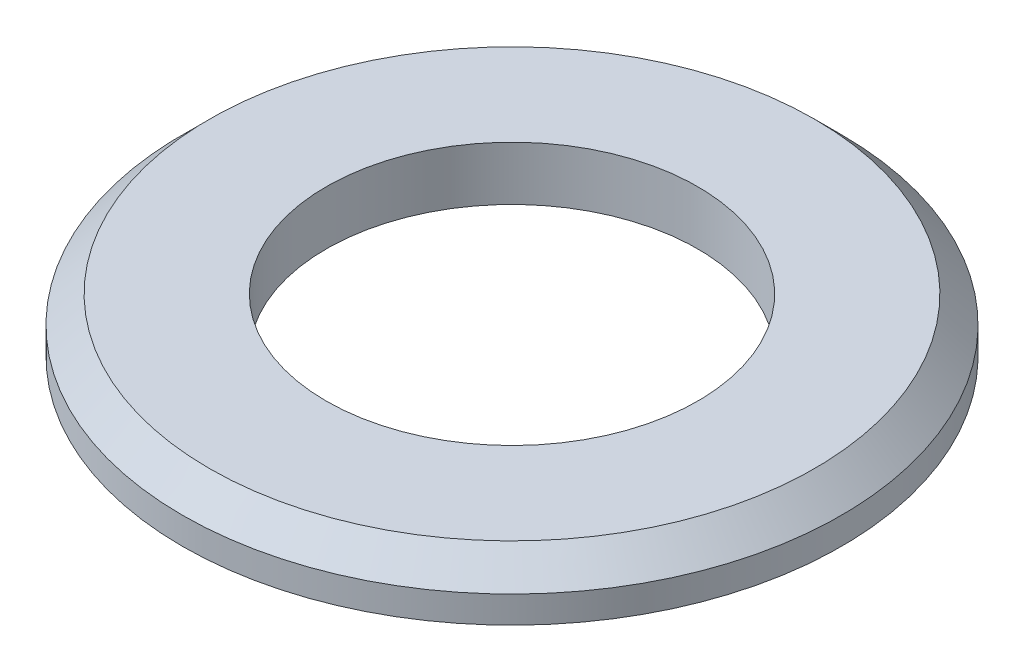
ISO-10303-21;
HEADER;
FILE_DESCRIPTION(('STEP AP214'),'2;1');
FILE_NAME('part.step','',(''),(''),'','','');
FILE_SCHEMA(('AUTOMOTIVE_DESIGN { 1 0 10303 214 1 1 1 1 }'));
ENDSEC;
DATA;
#1=APPLICATION_CONTEXT('core data for automotive mechanical design processes');
#2=APPLICATION_PROTOCOL_DEFINITION('international standard','automotive_design',2000,#1);
#3=PRODUCT_CONTEXT('',#1,'mechanical');
#4=PRODUCT('Part','Part','',(#3));
#5=PRODUCT_RELATED_PRODUCT_CATEGORY('part','',(#4));
#6=PRODUCT_DEFINITION_FORMATION('','',#4);
#7=PRODUCT_DEFINITION_CONTEXT('part definition',#1,'design');
#8=PRODUCT_DEFINITION('design','',#6,#7);
#9=PRODUCT_DEFINITION_SHAPE('','',#8);
#10=(LENGTH_UNIT() NAMED_UNIT(*) SI_UNIT(.MILLI.,.METRE.));
#11=(NAMED_UNIT(*) PLANE_ANGLE_UNIT() SI_UNIT($,.RADIAN.));
#12=(NAMED_UNIT(*) SI_UNIT($,.STERADIAN.) SOLID_ANGLE_UNIT());
#13=UNCERTAINTY_MEASURE_WITH_UNIT(LENGTH_MEASURE(1.E-05),#10,'distance_accuracy_value','');
#14=(GEOMETRIC_REPRESENTATION_CONTEXT(3) GLOBAL_UNCERTAINTY_ASSIGNED_CONTEXT((#13)) GLOBAL_UNIT_ASSIGNED_CONTEXT((#10,
#11,#12)) REPRESENTATION_CONTEXT('',''));
#15=CARTESIAN_POINT('',(0.,0.,0.));
#16=DIRECTION('',(0.,0.,1.));
#17=DIRECTION('',(1.,0.,0.));
#18=AXIS2_PLACEMENT_3D('',#15,#16,#17);
#19=CARTESIAN_POINT('',(0.,9.,0.));
#20=DIRECTION('',(0.,1.,0.));
#21=DIRECTION('',(0.,0.,1.));
#22=AXIS2_PLACEMENT_3D('',#19,#20,#21);
#23=PLANE('',#22);
#24=CARTESIAN_POINT('',(0.,9.,0.));
#25=DIRECTION('',(0.,1.,0.));
#26=DIRECTION('',(0.,0.,1.));
#27=AXIS2_PLACEMENT_3D('',#24,#25,#26);
#28=CIRCLE('',#27,50.5);
#29=CARTESIAN_POINT('',(0.,9.,50.5));
#30=VERTEX_POINT('',#29);
#31=EDGE_CURVE('E35',#30,#30,#28,.T.);
#32=ORIENTED_EDGE('',*,*,#31,.T.);
#33=EDGE_LOOP('',(#32));
#34=FACE_BOUND('',#33,.T.);
#35=CARTESIAN_POINT('',(0.,9.,0.));
#36=DIRECTION('',(0.,1.,0.));
#37=DIRECTION('',(0.,0.,1.));
#38=AXIS2_PLACEMENT_3D('',#35,#36,#37);
#39=CIRCLE('',#38,31.);
#40=CARTESIAN_POINT('',(0.,9.,31.));
#41=VERTEX_POINT('',#40);
#42=EDGE_CURVE('E43',#41,#41,#39,.T.);
#43=ORIENTED_EDGE('',*,*,#42,.F.);
#44=EDGE_LOOP('',(#43));
#45=FACE_BOUND('',#44,.T.);
#46=ADVANCED_FACE('F28',(#34,#45),#23,.T.);
#47=CARTESIAN_POINT('',(0.,0.,0.));
#48=DIRECTION('',(0.,1.,0.));
#49=DIRECTION('',(0.,0.,1.));
#50=AXIS2_PLACEMENT_3D('',#47,#48,#49);
#51=PLANE('',#50);
#52=CARTESIAN_POINT('',(0.,0.,0.));
#53=DIRECTION('',(0.,1.,0.));
#54=DIRECTION('',(0.,0.,1.));
#55=AXIS2_PLACEMENT_3D('',#52,#53,#54);
#56=CIRCLE('',#55,55.);
#57=CARTESIAN_POINT('',(0.,0.,55.));
#58=VERTEX_POINT('',#57);
#59=EDGE_CURVE('E39',#58,#58,#56,.T.);
#60=ORIENTED_EDGE('',*,*,#59,.F.);
#61=EDGE_LOOP('',(#60));
#62=FACE_BOUND('',#61,.T.);
#63=CARTESIAN_POINT('',(0.,0.,0.));
#64=DIRECTION('',(0.,1.,0.));
#65=DIRECTION('',(0.,0.,1.));
#66=AXIS2_PLACEMENT_3D('',#63,#64,#65);
#67=CIRCLE('',#66,31.);
#68=CARTESIAN_POINT('',(0.,0.,31.));
#69=VERTEX_POINT('',#68);
#70=EDGE_CURVE('E48',#69,#69,#67,.T.);
#71=ORIENTED_EDGE('',*,*,#70,.T.);
#72=EDGE_LOOP('',(#71));
#73=FACE_BOUND('',#72,.T.);
#74=ADVANCED_FACE('F52',(#62,#73),#51,.F.);
#75=CARTESIAN_POINT('',(0.,9.,0.));
#76=DIRECTION('',(0.,-1.,0.));
#77=DIRECTION('',(0.,0.,-1.));
#78=AXIS2_PLACEMENT_3D('',#75,#76,#77);
#79=CYLINDRICAL_SURFACE('',#78,55.);
#80=CARTESIAN_POINT('',(0.,4.5,0.));
#81=DIRECTION('',(0.,1.,0.));
#82=DIRECTION('',(0.,0.,1.));
#83=AXIS2_PLACEMENT_3D('',#80,#81,#82);
#84=CIRCLE('',#83,55.);
#85=CARTESIAN_POINT('',(0.,4.5,55.));
#86=VERTEX_POINT('',#85);
#87=EDGE_CURVE('E10',#86,#86,#84,.F.);
#88=ORIENTED_EDGE('',*,*,#87,.T.);
#89=EDGE_LOOP('',(#88));
#90=FACE_BOUND('',#89,.T.);
#91=ORIENTED_EDGE('',*,*,#59,.T.);
#92=EDGE_LOOP('',(#91));
#93=FACE_BOUND('',#92,.T.);
#94=ADVANCED_FACE('F30',(#90,#93),#79,.T.);
#95=CARTESIAN_POINT('',(0.,9.,0.));
#96=DIRECTION('',(0.,-1.,0.));
#97=DIRECTION('',(0.,0.,-1.));
#98=AXIS2_PLACEMENT_3D('',#95,#96,#97);
#99=CYLINDRICAL_SURFACE('',#98,31.);
#100=ORIENTED_EDGE('',*,*,#42,.T.);
#101=EDGE_LOOP('',(#100));
#102=FACE_BOUND('',#101,.T.);
#103=ORIENTED_EDGE('',*,*,#70,.F.);
#104=EDGE_LOOP('',(#103));
#105=FACE_BOUND('',#104,.T.);
#106=ADVANCED_FACE('F54',(#102,#105),#99,.F.);
#107=CARTESIAN_POINT('',(0.,9.,0.));
#108=DIRECTION('',(0.,-1.,0.));
#109=DIRECTION('',(0.,0.,-1.));
#110=AXIS2_PLACEMENT_3D('',#107,#108,#109);
#111=CONICAL_SURFACE('',#110,50.5,0.785398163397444);
#112=ORIENTED_EDGE('',*,*,#87,.F.);
#113=EDGE_LOOP('',(#112));
#114=FACE_BOUND('',#113,.T.);
#115=ORIENTED_EDGE('',*,*,#31,.F.);
#116=EDGE_LOOP('',(#115));
#117=FACE_BOUND('',#116,.T.);
#118=ADVANCED_FACE('F56',(#114,#117),#111,.T.);
#119=CLOSED_SHELL('',(#46,#74,#94,#106,#118));
#120=MANIFOLD_SOLID_BREP('B2',#119);
#121=ADVANCED_BREP_SHAPE_REPRESENTATION('',(#18,#120),#14);
#122=SHAPE_DEFINITION_REPRESENTATION(#9,#121);
ENDSEC;
END-ISO-10303-21;
